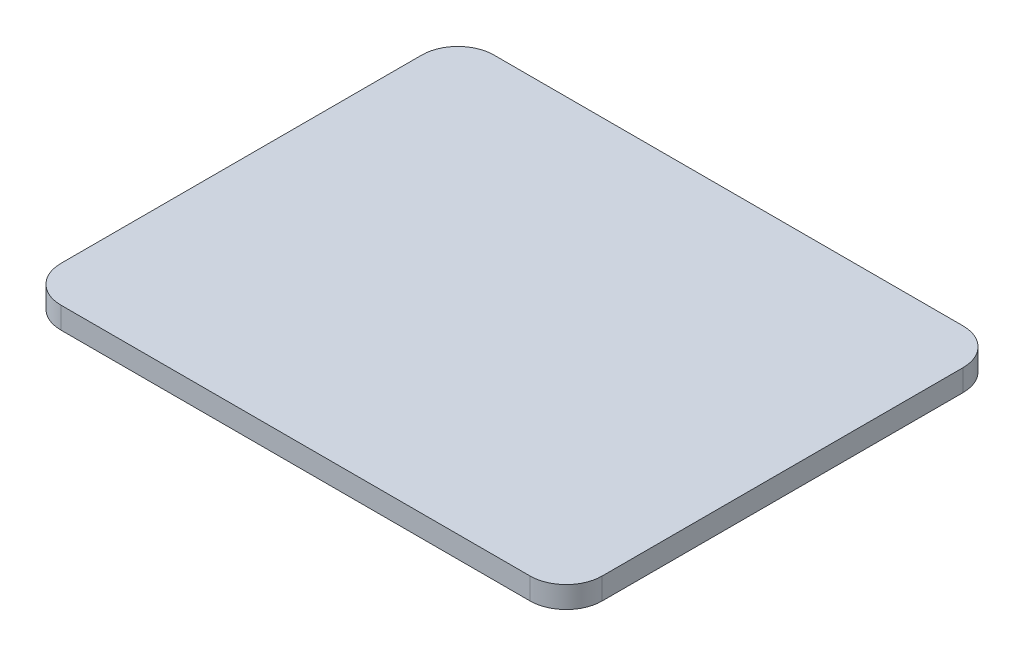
ISO-10303-21;
HEADER;
FILE_DESCRIPTION(('STEP AP214'),'2;1');
FILE_NAME('part.step','',(''),(''),'','','');
FILE_SCHEMA(('AUTOMOTIVE_DESIGN { 1 0 10303 214 1 1 1 1 }'));
ENDSEC;
DATA;
#1=APPLICATION_CONTEXT('core data for automotive mechanical design processes');
#2=APPLICATION_PROTOCOL_DEFINITION('international standard','automotive_design',2000,#1);
#3=PRODUCT_CONTEXT('',#1,'mechanical');
#4=PRODUCT('Part','Part','',(#3));
#5=PRODUCT_RELATED_PRODUCT_CATEGORY('part','',(#4));
#6=PRODUCT_DEFINITION_FORMATION('','',#4);
#7=PRODUCT_DEFINITION_CONTEXT('part definition',#1,'design');
#8=PRODUCT_DEFINITION('design','',#6,#7);
#9=PRODUCT_DEFINITION_SHAPE('','',#8);
#10=(LENGTH_UNIT() NAMED_UNIT(*) SI_UNIT(.MILLI.,.METRE.));
#11=(NAMED_UNIT(*) PLANE_ANGLE_UNIT() SI_UNIT($,.RADIAN.));
#12=(NAMED_UNIT(*) SI_UNIT($,.STERADIAN.) SOLID_ANGLE_UNIT());
#13=UNCERTAINTY_MEASURE_WITH_UNIT(LENGTH_MEASURE(1.E-05),#10,'distance_accuracy_value','');
#14=(GEOMETRIC_REPRESENTATION_CONTEXT(3) GLOBAL_UNCERTAINTY_ASSIGNED_CONTEXT((#13)) GLOBAL_UNIT_ASSIGNED_CONTEXT((#10,
#11,#12)) REPRESENTATION_CONTEXT('',''));
#15=CARTESIAN_POINT('',(0.,0.,0.));
#16=DIRECTION('',(0.,0.,1.));
#17=DIRECTION('',(1.,0.,0.));
#18=AXIS2_PLACEMENT_3D('',#15,#16,#17);
#19=CARTESIAN_POINT('',(65.,6.,-50.));
#20=DIRECTION('',(0.,-1.,0.));
#21=DIRECTION('',(0.,0.,-1.));
#22=AXIS2_PLACEMENT_3D('',#19,#20,#21);
#23=CYLINDRICAL_SURFACE('',#22,10.);
#24=CARTESIAN_POINT('',(65.,0.,-50.));
#25=DIRECTION('',(0.,1.,0.));
#26=DIRECTION('',(0.,0.,-1.));
#27=AXIS2_PLACEMENT_3D('',#24,#25,#26);
#28=CIRCLE('',#27,10.);
#29=CARTESIAN_POINT('',(75.,0.,-50.));
#30=VERTEX_POINT('',#29);
#31=CARTESIAN_POINT('',(65.,0.,-60.));
#32=VERTEX_POINT('',#31);
#33=EDGE_CURVE('E113',#30,#32,#28,.T.);
#34=ORIENTED_EDGE('',*,*,#33,.T.);
#35=DIRECTION('',(0.,-1.,0.));
#36=VECTOR('',#35,1.);
#37=CARTESIAN_POINT('',(65.,6.,-60.));
#38=LINE('',#37,#36);
#39=CARTESIAN_POINT('',(65.,6.,-60.));
#40=VERTEX_POINT('',#39);
#41=EDGE_CURVE('E11',#40,#32,#38,.T.);
#42=ORIENTED_EDGE('',*,*,#41,.F.);
#43=CARTESIAN_POINT('',(65.,6.,-50.));
#44=DIRECTION('',(0.,1.,0.));
#45=DIRECTION('',(0.,0.,-1.));
#46=AXIS2_PLACEMENT_3D('',#43,#44,#45);
#47=CIRCLE('',#46,10.);
#48=CARTESIAN_POINT('',(75.,6.,-50.));
#49=VERTEX_POINT('',#48);
#50=EDGE_CURVE('E127',#49,#40,#47,.T.);
#51=ORIENTED_EDGE('',*,*,#50,.F.);
#52=DIRECTION('',(0.,-1.,0.));
#53=VECTOR('',#52,1.);
#54=CARTESIAN_POINT('',(75.,6.,-50.));
#55=LINE('',#54,#53);
#56=EDGE_CURVE('E109',#49,#30,#55,.T.);
#57=ORIENTED_EDGE('',*,*,#56,.T.);
#58=EDGE_LOOP('',(#34,#42,#51,#57));
#59=FACE_BOUND('',#58,.T.);
#60=ADVANCED_FACE('F17',(#59),#23,.T.);
#61=CARTESIAN_POINT('',(-65.,6.,-60.));
#62=DIRECTION('',(0.,0.,1.));
#63=DIRECTION('',(1.,0.,0.));
#64=AXIS2_PLACEMENT_3D('',#61,#62,#63);
#65=PLANE('',#64);
#66=DIRECTION('',(-1.,0.,0.));
#67=VECTOR('',#66,1.);
#68=CARTESIAN_POINT('',(-65.,0.,-60.));
#69=LINE('',#68,#67);
#70=CARTESIAN_POINT('',(-65.,0.,-60.));
#71=VERTEX_POINT('',#70);
#72=EDGE_CURVE('E116',#32,#71,#69,.T.);
#73=ORIENTED_EDGE('',*,*,#72,.T.);
#74=DIRECTION('',(0.,-1.,0.));
#75=VECTOR('',#74,1.);
#76=CARTESIAN_POINT('',(-65.,6.,-60.));
#77=LINE('',#76,#75);
#78=CARTESIAN_POINT('',(-65.,6.,-60.));
#79=VERTEX_POINT('',#78);
#80=EDGE_CURVE('E25',#79,#71,#77,.T.);
#81=ORIENTED_EDGE('',*,*,#80,.F.);
#82=DIRECTION('',(-1.,0.,0.));
#83=VECTOR('',#82,1.);
#84=CARTESIAN_POINT('',(-65.,6.,-60.));
#85=LINE('',#84,#83);
#86=EDGE_CURVE('E76',#40,#79,#85,.T.);
#87=ORIENTED_EDGE('',*,*,#86,.F.);
#88=ORIENTED_EDGE('',*,*,#41,.T.);
#89=EDGE_LOOP('',(#73,#81,#87,#88));
#90=FACE_BOUND('',#89,.T.);
#91=ADVANCED_FACE('F162',(#90),#65,.F.);
#92=CARTESIAN_POINT('',(-65.,6.,-50.));
#93=DIRECTION('',(0.,-1.,0.));
#94=DIRECTION('',(0.,0.,-1.));
#95=AXIS2_PLACEMENT_3D('',#92,#93,#94);
#96=CYLINDRICAL_SURFACE('',#95,10.);
#97=CARTESIAN_POINT('',(-65.,0.,-50.));
#98=DIRECTION('',(0.,1.,0.));
#99=DIRECTION('',(0.,0.,-1.));
#100=AXIS2_PLACEMENT_3D('',#97,#98,#99);
#101=CIRCLE('',#100,10.);
#102=CARTESIAN_POINT('',(-75.,0.,-50.));
#103=VERTEX_POINT('',#102);
#104=EDGE_CURVE('E118',#71,#103,#101,.T.);
#105=ORIENTED_EDGE('',*,*,#104,.T.);
#106=DIRECTION('',(0.,-1.,0.));
#107=VECTOR('',#106,1.);
#108=CARTESIAN_POINT('',(-75.,6.,-50.));
#109=LINE('',#108,#107);
#110=CARTESIAN_POINT('',(-75.,6.,-50.));
#111=VERTEX_POINT('',#110);
#112=EDGE_CURVE('E134',#111,#103,#109,.T.);
#113=ORIENTED_EDGE('',*,*,#112,.F.);
#114=CARTESIAN_POINT('',(-65.,6.,-50.));
#115=DIRECTION('',(0.,1.,0.));
#116=DIRECTION('',(0.,0.,-1.));
#117=AXIS2_PLACEMENT_3D('',#114,#115,#116);
#118=CIRCLE('',#117,10.);
#119=EDGE_CURVE('E142',#79,#111,#118,.T.);
#120=ORIENTED_EDGE('',*,*,#119,.F.);
#121=ORIENTED_EDGE('',*,*,#80,.T.);
#122=EDGE_LOOP('',(#105,#113,#120,#121));
#123=FACE_BOUND('',#122,.T.);
#124=ADVANCED_FACE('F140',(#123),#96,.T.);
#125=CARTESIAN_POINT('',(-75.,6.,50.));
#126=DIRECTION('',(1.,0.,0.));
#127=DIRECTION('',(0.,0.,-1.));
#128=AXIS2_PLACEMENT_3D('',#125,#126,#127);
#129=PLANE('',#128);
#130=DIRECTION('',(0.,0.,1.));
#131=VECTOR('',#130,1.);
#132=CARTESIAN_POINT('',(-75.,0.,50.));
#133=LINE('',#132,#131);
#134=CARTESIAN_POINT('',(-75.,0.,50.));
#135=VERTEX_POINT('',#134);
#136=EDGE_CURVE('E120',#103,#135,#133,.T.);
#137=ORIENTED_EDGE('',*,*,#136,.T.);
#138=DIRECTION('',(0.,-1.,0.));
#139=VECTOR('',#138,1.);
#140=CARTESIAN_POINT('',(-75.,6.,50.));
#141=LINE('',#140,#139);
#142=CARTESIAN_POINT('',(-75.,6.,50.));
#143=VERTEX_POINT('',#142);
#144=EDGE_CURVE('E131',#143,#135,#141,.T.);
#145=ORIENTED_EDGE('',*,*,#144,.F.);
#146=DIRECTION('',(0.,0.,1.));
#147=VECTOR('',#146,1.);
#148=CARTESIAN_POINT('',(-75.,6.,50.));
#149=LINE('',#148,#147);
#150=EDGE_CURVE('E154',#111,#143,#149,.T.);
#151=ORIENTED_EDGE('',*,*,#150,.F.);
#152=ORIENTED_EDGE('',*,*,#112,.T.);
#153=EDGE_LOOP('',(#137,#145,#151,#152));
#154=FACE_BOUND('',#153,.T.);
#155=ADVANCED_FACE('F150',(#154),#129,.F.);
#156=CARTESIAN_POINT('',(-65.,6.,50.));
#157=DIRECTION('',(0.,-1.,0.));
#158=DIRECTION('',(0.,0.,-1.));
#159=AXIS2_PLACEMENT_3D('',#156,#157,#158);
#160=CYLINDRICAL_SURFACE('',#159,10.);
#161=CARTESIAN_POINT('',(-65.,0.,50.));
#162=DIRECTION('',(0.,1.,0.));
#163=DIRECTION('',(0.,0.,-1.));
#164=AXIS2_PLACEMENT_3D('',#161,#162,#163);
#165=CIRCLE('',#164,10.);
#166=CARTESIAN_POINT('',(-65.,0.,60.));
#167=VERTEX_POINT('',#166);
#168=EDGE_CURVE('E122',#135,#167,#165,.T.);
#169=ORIENTED_EDGE('',*,*,#168,.T.);
#170=DIRECTION('',(0.,-1.,0.));
#171=VECTOR('',#170,1.);
#172=CARTESIAN_POINT('',(-65.,6.,60.));
#173=LINE('',#172,#171);
#174=CARTESIAN_POINT('',(-65.,6.,60.));
#175=VERTEX_POINT('',#174);
#176=EDGE_CURVE('E104',#175,#167,#173,.T.);
#177=ORIENTED_EDGE('',*,*,#176,.F.);
#178=CARTESIAN_POINT('',(-65.,6.,50.));
#179=DIRECTION('',(0.,1.,0.));
#180=DIRECTION('',(0.,0.,-1.));
#181=AXIS2_PLACEMENT_3D('',#178,#179,#180);
#182=CIRCLE('',#181,10.);
#183=EDGE_CURVE('E95',#143,#175,#182,.T.);
#184=ORIENTED_EDGE('',*,*,#183,.F.);
#185=ORIENTED_EDGE('',*,*,#144,.T.);
#186=EDGE_LOOP('',(#169,#177,#184,#185));
#187=FACE_BOUND('',#186,.T.);
#188=ADVANCED_FACE('F153',(#187),#160,.T.);
#189=CARTESIAN_POINT('',(-65.,6.,60.));
#190=DIRECTION('',(0.,0.,-1.));
#191=DIRECTION('',(-1.,0.,0.));
#192=AXIS2_PLACEMENT_3D('',#189,#190,#191);
#193=PLANE('',#192);
#194=DIRECTION('',(1.,0.,0.));
#195=VECTOR('',#194,1.);
#196=CARTESIAN_POINT('',(-65.,0.,60.));
#197=LINE('',#196,#195);
#198=CARTESIAN_POINT('',(65.,0.,60.));
#199=VERTEX_POINT('',#198);
#200=EDGE_CURVE('E103',#167,#199,#197,.T.);
#201=ORIENTED_EDGE('',*,*,#200,.T.);
#202=DIRECTION('',(0.,-1.,0.));
#203=VECTOR('',#202,1.);
#204=CARTESIAN_POINT('',(65.,6.,60.));
#205=LINE('',#204,#203);
#206=CARTESIAN_POINT('',(65.,6.,60.));
#207=VERTEX_POINT('',#206);
#208=EDGE_CURVE('E100',#207,#199,#205,.T.);
#209=ORIENTED_EDGE('',*,*,#208,.F.);
#210=DIRECTION('',(1.,0.,0.));
#211=VECTOR('',#210,1.);
#212=CARTESIAN_POINT('',(-65.,6.,60.));
#213=LINE('',#212,#211);
#214=EDGE_CURVE('E89',#175,#207,#213,.T.);
#215=ORIENTED_EDGE('',*,*,#214,.F.);
#216=ORIENTED_EDGE('',*,*,#176,.T.);
#217=EDGE_LOOP('',(#201,#209,#215,#216));
#218=FACE_BOUND('',#217,.T.);
#219=ADVANCED_FACE('F101',(#218),#193,.F.);
#220=CARTESIAN_POINT('',(65.,6.,50.));
#221=DIRECTION('',(0.,-1.,0.));
#222=DIRECTION('',(0.,0.,-1.));
#223=AXIS2_PLACEMENT_3D('',#220,#221,#222);
#224=CYLINDRICAL_SURFACE('',#223,10.);
#225=CARTESIAN_POINT('',(65.,0.,50.));
#226=DIRECTION('',(0.,1.,0.));
#227=DIRECTION('',(0.,0.,1.));
#228=AXIS2_PLACEMENT_3D('',#225,#226,#227);
#229=CIRCLE('',#228,10.);
#230=CARTESIAN_POINT('',(75.,0.,50.));
#231=VERTEX_POINT('',#230);
#232=EDGE_CURVE('E62',#199,#231,#229,.T.);
#233=ORIENTED_EDGE('',*,*,#232,.T.);
#234=DIRECTION('',(0.,-1.,0.));
#235=VECTOR('',#234,1.);
#236=CARTESIAN_POINT('',(75.,6.,50.));
#237=LINE('',#236,#235);
#238=CARTESIAN_POINT('',(75.,6.,50.));
#239=VERTEX_POINT('',#238);
#240=EDGE_CURVE('E105',#239,#231,#237,.T.);
#241=ORIENTED_EDGE('',*,*,#240,.F.);
#242=CARTESIAN_POINT('',(65.,6.,50.));
#243=DIRECTION('',(0.,1.,0.));
#244=DIRECTION('',(0.,0.,1.));
#245=AXIS2_PLACEMENT_3D('',#242,#243,#244);
#246=CIRCLE('',#245,10.);
#247=EDGE_CURVE('E93',#207,#239,#246,.T.);
#248=ORIENTED_EDGE('',*,*,#247,.F.);
#249=ORIENTED_EDGE('',*,*,#208,.T.);
#250=EDGE_LOOP('',(#233,#241,#248,#249));
#251=FACE_BOUND('',#250,.T.);
#252=ADVANCED_FACE('F107',(#251),#224,.T.);
#253=CARTESIAN_POINT('',(75.,6.,50.));
#254=DIRECTION('',(-1.,0.,0.));
#255=DIRECTION('',(0.,0.,1.));
#256=AXIS2_PLACEMENT_3D('',#253,#254,#255);
#257=PLANE('',#256);
#258=DIRECTION('',(0.,0.,-1.));
#259=VECTOR('',#258,1.);
#260=CARTESIAN_POINT('',(75.,0.,50.));
#261=LINE('',#260,#259);
#262=EDGE_CURVE('E68',#231,#30,#261,.T.);
#263=ORIENTED_EDGE('',*,*,#262,.T.);
#264=ORIENTED_EDGE('',*,*,#56,.F.);
#265=DIRECTION('',(0.,0.,-1.));
#266=VECTOR('',#265,1.);
#267=CARTESIAN_POINT('',(75.,6.,50.));
#268=LINE('',#267,#266);
#269=EDGE_CURVE('E33',#239,#49,#268,.T.);
#270=ORIENTED_EDGE('',*,*,#269,.F.);
#271=ORIENTED_EDGE('',*,*,#240,.T.);
#272=EDGE_LOOP('',(#263,#264,#270,#271));
#273=FACE_BOUND('',#272,.T.);
#274=ADVANCED_FACE('F180',(#273),#257,.F.);
#275=CARTESIAN_POINT('',(65.,6.,-50.));
#276=DIRECTION('',(0.,-1.,0.));
#277=DIRECTION('',(0.,0.,-1.));
#278=AXIS2_PLACEMENT_3D('',#275,#276,#277);
#279=PLANE('',#278);
#280=ORIENTED_EDGE('',*,*,#50,.T.);
#281=ORIENTED_EDGE('',*,*,#86,.T.);
#282=ORIENTED_EDGE('',*,*,#119,.T.);
#283=ORIENTED_EDGE('',*,*,#150,.T.);
#284=ORIENTED_EDGE('',*,*,#183,.T.);
#285=ORIENTED_EDGE('',*,*,#214,.T.);
#286=ORIENTED_EDGE('',*,*,#247,.T.);
#287=ORIENTED_EDGE('',*,*,#269,.T.);
#288=EDGE_LOOP('',(#280,#281,#282,#283,#284,#285,#286,#287));
#289=FACE_BOUND('',#288,.T.);
#290=ADVANCED_FACE('F91',(#289),#279,.F.);
#291=CARTESIAN_POINT('',(65.,0.,-50.));
#292=DIRECTION('',(0.,-1.,0.));
#293=DIRECTION('',(0.,0.,-1.));
#294=AXIS2_PLACEMENT_3D('',#291,#292,#293);
#295=PLANE('',#294);
#296=ORIENTED_EDGE('',*,*,#33,.F.);
#297=ORIENTED_EDGE('',*,*,#262,.F.);
#298=ORIENTED_EDGE('',*,*,#232,.F.);
#299=ORIENTED_EDGE('',*,*,#200,.F.);
#300=ORIENTED_EDGE('',*,*,#168,.F.);
#301=ORIENTED_EDGE('',*,*,#136,.F.);
#302=ORIENTED_EDGE('',*,*,#104,.F.);
#303=ORIENTED_EDGE('',*,*,#72,.F.);
#304=EDGE_LOOP('',(#296,#297,#298,#299,#300,#301,#302,#303));
#305=FACE_BOUND('',#304,.T.);
#306=ADVANCED_FACE('F146',(#305),#295,.T.);
#307=CLOSED_SHELL('',(#60,#91,#124,#155,#188,#219,#252,#274,#290,#306));
#308=MANIFOLD_SOLID_BREP('B1',#307);
#309=ADVANCED_BREP_SHAPE_REPRESENTATION('',(#18,#308),#14);
#310=SHAPE_DEFINITION_REPRESENTATION(#9,#309);
ENDSEC;
END-ISO-10303-21;
